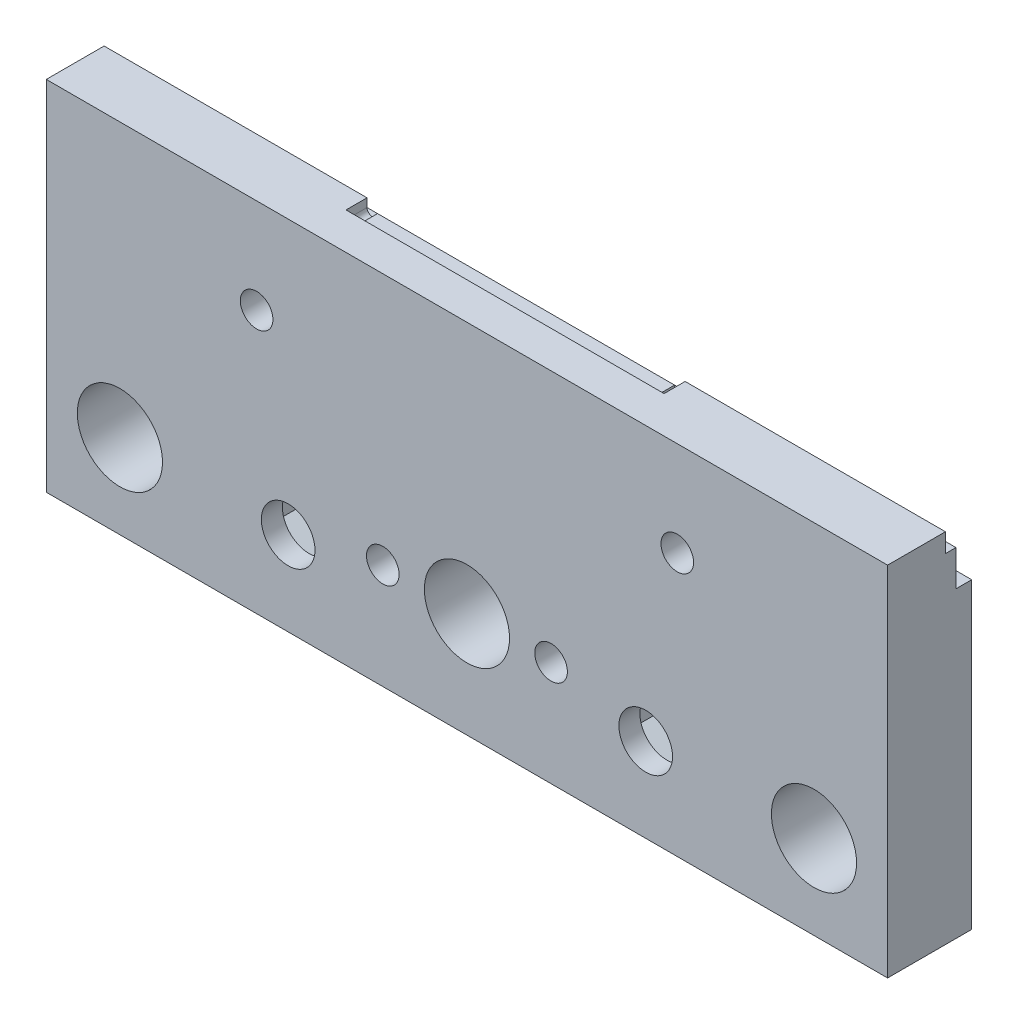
from build123d import *

# Parameters (mm, degrees)
SKETCH_2_W           = 80
SKETCH_2_H           = 34
SKETCH_2_R           = 4.05
EXTRUDE_1_DEPTH      = 8
SKETCH_3_R           = 2.55
CUT_EXTRUDE_1_DEPTH  = 88.292611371
CUT_EXTRUDE_2_DEPTH  = 88.292611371
SKETCH_5_R           = 1.55
CUT_EXTRUDE_3_DEPTH  = 88.292611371
CUT_EXTRUDE_5_DEPTH  = 4.5
SKETCH_11_R          = 1.55
CUT_EXTRUDE_7_DEPTH  = 88.292611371
CUT_EXTRUDE_11_DEPTH = 2
CUT_EXTRUDE_13_DEPTH = 6


with BuildPart() as part:
    # Sketch 2 → Extrude 1 (new body)
    with BuildSketch(Plane.XY):
        with Locations((40, 17)):
            Rectangle(SKETCH_2_W, SKETCH_2_H)
        with Locations((7, 8)):
            Circle(SKETCH_2_R, mode=Mode.SUBTRACT)
        with Locations((40, 10)):
            Circle(SKETCH_2_R, mode=Mode.SUBTRACT)
        with Locations((73, 8)):
            Circle(SKETCH_2_R, mode=Mode.SUBTRACT)
    extrude(amount=EXTRUDE_1_DEPTH)

    # Sketch 3 → Cut-Extrude 1 (cut, through all)
    with BuildSketch(Plane.XY.offset(8)):
        with Locations((23, 8)):
            Circle(SKETCH_3_R)
        with Locations((57, 8)):
            Circle(SKETCH_3_R)
    extrude(amount=-CUT_EXTRUDE_1_DEPTH, mode=Mode.SUBTRACT)

    # Sketch 4 → Cut-Extrude 2 (cut, through all)
    with BuildSketch(Plane(origin=(80, 0, 0), x_dir=(0, 0, -1), z_dir=(1, 0, 0))):
        Polygon((-1.5, 32.2), (-2.5, 32.2), (-2.5, 34), (0, 34), (0, 28.8), (-1.5, 28.8), align=None)
    extrude(amount=-CUT_EXTRUDE_2_DEPTH, mode=Mode.SUBTRACT)

    # Sketch 5 → Cut-Extrude 3 (cut, through all)
    with BuildSketch(Plane.XY.offset(8)):
        with Locations((48, 10)):
            Circle(SKETCH_5_R)
        with Locations((32, 10)):
            Circle(SKETCH_5_R)
    extrude(amount=-CUT_EXTRUDE_3_DEPTH, mode=Mode.SUBTRACT)

    # Sketch 8 → Cut-Extrude 5 (cut)
    with BuildSketch(Plane(origin=(0, 0, 0), x_dir=(-1, 0, 0), z_dir=(0, 0, -1))):
        Polygon((-45.15, 8.354551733), (-45.15, 11.645448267), (-48, 13.290896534), (-50.85, 11.645448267), (-50.85, 8.354551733), (-48, 6.709103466), align=None)
        Polygon((-29.15, 8.354551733), (-29.15, 11.645448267), (-32, 13.290896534), (-34.85, 11.645448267), (-34.85, 8.354551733), (-32, 6.709103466), align=None)
    extrude(amount=-CUT_EXTRUDE_5_DEPTH, mode=Mode.SUBTRACT)

    # Sketch 11 → Cut-Extrude 7 (cut, through all)
    with BuildSketch(Plane(origin=(0, 0, 0), x_dir=(-1, 0, 0), z_dir=(0, 0, -1))):
        with Locations((-60, 25)):
            Circle(SKETCH_11_R)
        with Locations((-20, 25)):
            Circle(SKETCH_11_R)
    extrude(amount=-CUT_EXTRUDE_7_DEPTH, mode=Mode.SUBTRACT)

    # Sketch 19 → Cut-Extrude 11 (cut)
    with BuildSketch(Plane(origin=(0, 0, 2.5), x_dir=(-1, 0, 0), z_dir=(0, 0, -1))):
        with BuildLine():
            Line((-25, 34), (-55.247938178, 34))
            Line((-55.247938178, 34), (-55.247938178, 33.2))
            ThreePointArc((-55.247938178, 33.2), (-54.747938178, 32.7), (-54.247938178, 33.2))
            Line((-54.247938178, 33.2), (-26, 33.2))
            ThreePointArc((-26, 33.2), (-25.5, 32.7), (-25, 33.2))
            Line((-25, 33.2), (-25, 34))
        make_face()
    extrude(amount=-CUT_EXTRUDE_11_DEPTH, mode=Mode.SUBTRACT)

    # Sketch 7 → Cut-Extrude 13 (cut)
    with BuildSketch(Plane(origin=(0, 0, 0), x_dir=(-1, 0, 0), z_dir=(0, 0, -1))):
        Polygon((-52.9, 5.632863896), (-52.9, 10.367136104), (-57, 12.734272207), (-61.1, 10.367136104), (-61.1, 5.632863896), (-57, 3.265727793), align=None)
        Polygon((-18.9, 5.632863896), (-18.9, 10.367136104), (-23, 12.734272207), (-27.1, 10.367136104), (-27.1, 5.632863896), (-23, 3.265727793), align=None)
    extrude(amount=-CUT_EXTRUDE_13_DEPTH, mode=Mode.SUBTRACT)


solid = part.part
